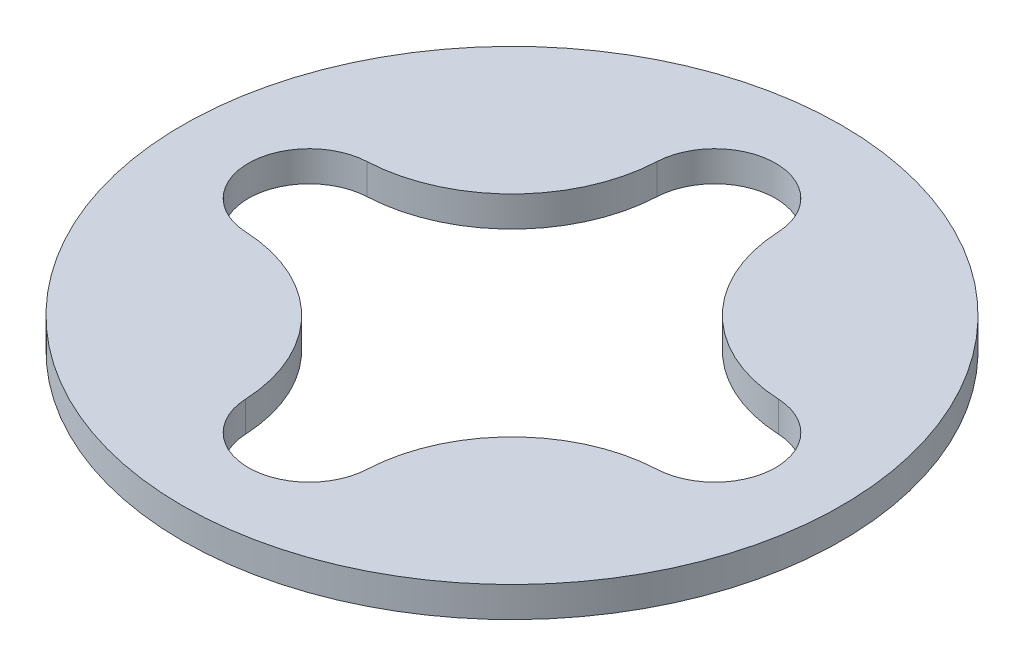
from build123d import *

# Parameters (mm, degrees)
SKETCH1_R      = 32.5
EXTRUDE1_DEPTH = 3


with BuildPart() as part:
    # Sketch1 → Extrude1 (new body)
    with BuildSketch(Plane(origin=(0, 0, 0), x_dir=(1, 0, 0), z_dir=(0, 1, 0))):
        with Locations(Location((0, 0, 0), (0, 0, 270))):
            Circle(SKETCH1_R)
        with BuildLine():
            ThreePointArc((20.279214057, -5.993499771), (26, 0), (20.279214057, 5.993499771))
            ThreePointArc((20.279214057, 5.993499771), (10.370647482, 10.370647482), (5.993499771, 20.279214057))
            ThreePointArc((5.993499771, 20.279214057), (0, 26), (-5.993499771, 20.279214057))
            ThreePointArc((-5.993499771, 20.279214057), (-10.370647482, 10.370647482), (-20.279214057, 5.993499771))
            ThreePointArc((-20.279214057, 5.993499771), (-26, 0), (-20.279214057, -5.993499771))
            ThreePointArc((-20.279214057, -5.993499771), (-10.370647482, -10.370647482), (-5.993499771, -20.279214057))
            ThreePointArc((-5.993499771, -20.279214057), (0, -26), (5.993499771, -20.279214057))
            ThreePointArc((5.993499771, -20.279214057), (10.370647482, -10.370647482), (20.279214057, -5.993499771))
        make_face(mode=Mode.SUBTRACT)
    extrude(amount=EXTRUDE1_DEPTH)


solid = part.part
